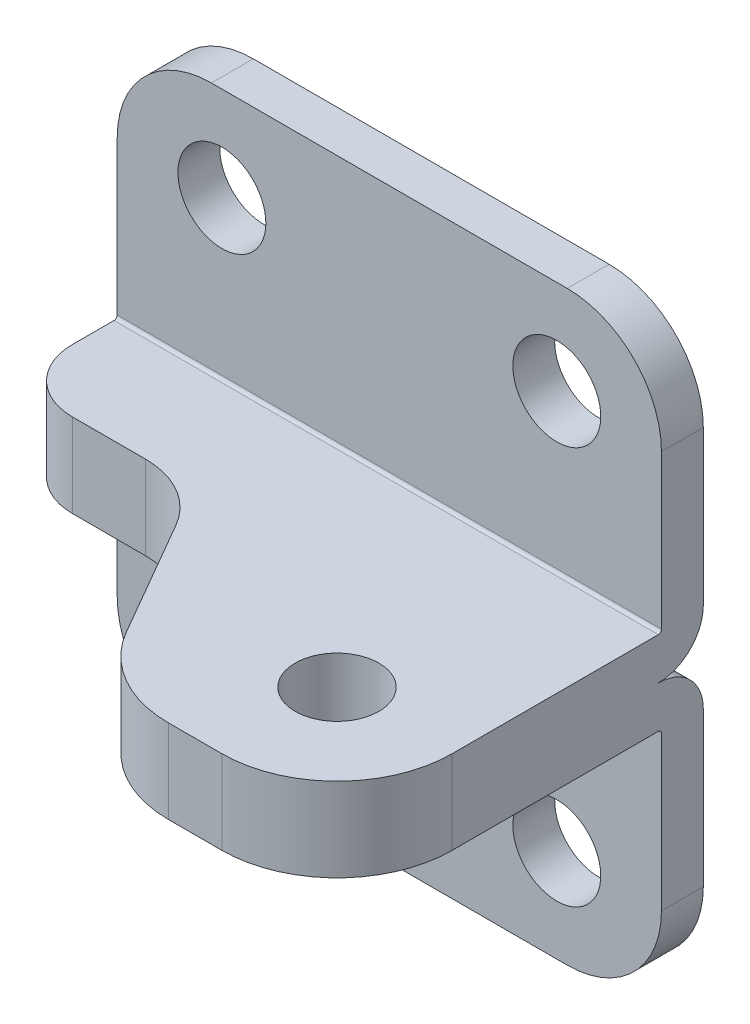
ISO-10303-21;
HEADER;
FILE_DESCRIPTION(('STEP AP214'),'2;1');
FILE_NAME('part.step','',(''),(''),'','','');
FILE_SCHEMA(('AUTOMOTIVE_DESIGN { 1 0 10303 214 1 1 1 1 }'));
ENDSEC;
DATA;
#1=APPLICATION_CONTEXT('core data for automotive mechanical design processes');
#2=APPLICATION_PROTOCOL_DEFINITION('international standard','automotive_design',2000,#1);
#3=PRODUCT_CONTEXT('',#1,'mechanical');
#4=PRODUCT('Part','Part','',(#3));
#5=PRODUCT_RELATED_PRODUCT_CATEGORY('part','',(#4));
#6=PRODUCT_DEFINITION_FORMATION('','',#4);
#7=PRODUCT_DEFINITION_CONTEXT('part definition',#1,'design');
#8=PRODUCT_DEFINITION('design','',#6,#7);
#9=PRODUCT_DEFINITION_SHAPE('','',#8);
#10=(LENGTH_UNIT() NAMED_UNIT(*) SI_UNIT(.MILLI.,.METRE.));
#11=(NAMED_UNIT(*) PLANE_ANGLE_UNIT() SI_UNIT($,.RADIAN.));
#12=(NAMED_UNIT(*) SI_UNIT($,.STERADIAN.) SOLID_ANGLE_UNIT());
#13=UNCERTAINTY_MEASURE_WITH_UNIT(LENGTH_MEASURE(1.E-05),#10,'distance_accuracy_value','');
#14=(GEOMETRIC_REPRESENTATION_CONTEXT(3) GLOBAL_UNCERTAINTY_ASSIGNED_CONTEXT((#13)) GLOBAL_UNIT_ASSIGNED_CONTEXT((#10,
#11,#12)) REPRESENTATION_CONTEXT('',''));
#15=CARTESIAN_POINT('',(0.,0.,0.));
#16=DIRECTION('',(0.,0.,1.));
#17=DIRECTION('',(1.,0.,0.));
#18=AXIS2_PLACEMENT_3D('',#15,#16,#17);
#19=CARTESIAN_POINT('',(8.70734122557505,27.9239179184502,0.320446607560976));
#20=DIRECTION('',(0.,-1.,0.));
#21=DIRECTION('',(0.,0.,-1.));
#22=AXIS2_PLACEMENT_3D('',#19,#20,#21);
#23=CYLINDRICAL_SURFACE('',#22,2.);
#24=CARTESIAN_POINT('',(8.70734122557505,27.9239179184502,0.320446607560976));
#25=DIRECTION('',(0.,-1.,0.));
#26=DIRECTION('',(0.,0.,-1.));
#27=AXIS2_PLACEMENT_3D('',#24,#25,#26);
#28=CIRCLE('',#27,2.);
#29=CARTESIAN_POINT('',(8.70734122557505,27.9239179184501,-1.67955339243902));
#30=VERTEX_POINT('',#29);
#31=EDGE_CURVE('E331',#30,#30,#28,.F.);
#32=ORIENTED_EDGE('',*,*,#31,.F.);
#33=EDGE_LOOP('',(#32));
#34=FACE_BOUND('',#33,.T.);
#35=CARTESIAN_POINT('',(8.70734122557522,31.9239179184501,0.320446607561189));
#36=DIRECTION('',(0.,-1.,0.));
#37=DIRECTION('',(0.,0.,-1.));
#38=AXIS2_PLACEMENT_3D('',#35,#36,#37);
#39=CIRCLE('',#38,2.);
#40=CARTESIAN_POINT('',(8.70734122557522,31.9239179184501,-1.67955339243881));
#41=VERTEX_POINT('',#40);
#42=EDGE_CURVE('E18',#41,#41,#39,.T.);
#43=ORIENTED_EDGE('',*,*,#42,.F.);
#44=EDGE_LOOP('',(#43));
#45=FACE_BOUND('',#44,.T.);
#46=ADVANCED_FACE('F14',(#34,#45),#23,.F.);
#47=CARTESIAN_POINT('',(8.70734122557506,27.9239179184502,0.320446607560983));
#48=DIRECTION('',(0.,1.,0.));
#49=DIRECTION('',(0.,0.,1.));
#50=AXIS2_PLACEMENT_3D('',#47,#48,#49);
#51=CYLINDRICAL_SURFACE('',#50,5.5);
#52=CARTESIAN_POINT('',(8.70734122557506,27.9239179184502,0.320446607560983));
#53=DIRECTION('',(0.,1.,0.));
#54=DIRECTION('',(0.,0.,1.));
#55=AXIS2_PLACEMENT_3D('',#52,#53,#54);
#56=CIRCLE('',#55,5.5);
#57=CARTESIAN_POINT('',(14.2073412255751,27.9239179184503,0.320446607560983));
#58=VERTEX_POINT('',#57);
#59=CARTESIAN_POINT('',(8.70734122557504,27.9239179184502,5.82044660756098));
#60=VERTEX_POINT('',#59);
#61=EDGE_CURVE('E173',#58,#60,#56,.F.);
#62=ORIENTED_EDGE('',*,*,#61,.F.);
#63=DIRECTION('',(0.,-1.,0.));
#64=VECTOR('',#63,1.);
#65=CARTESIAN_POINT('',(14.2073412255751,27.9239179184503,0.320446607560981));
#66=LINE('',#65,#64);
#67=CARTESIAN_POINT('',(14.2073412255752,31.9239179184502,0.320446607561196));
#68=VERTEX_POINT('',#67);
#69=EDGE_CURVE('E167',#58,#68,#66,.F.);
#70=ORIENTED_EDGE('',*,*,#69,.T.);
#71=CARTESIAN_POINT('',(8.70734122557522,31.9239179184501,0.320446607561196));
#72=DIRECTION('',(0.,1.,0.));
#73=DIRECTION('',(0.,0.,1.));
#74=AXIS2_PLACEMENT_3D('',#71,#72,#73);
#75=CIRCLE('',#74,5.5);
#76=CARTESIAN_POINT('',(8.70734122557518,31.92391791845,5.82044660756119));
#77=VERTEX_POINT('',#76);
#78=EDGE_CURVE('E170',#68,#77,#75,.F.);
#79=ORIENTED_EDGE('',*,*,#78,.T.);
#80=DIRECTION('',(0.,-1.,0.));
#81=VECTOR('',#80,1.);
#82=CARTESIAN_POINT('',(8.70734122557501,27.9239179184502,5.82044660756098));
#83=LINE('',#82,#81);
#84=EDGE_CURVE('E215',#77,#60,#83,.T.);
#85=ORIENTED_EDGE('',*,*,#84,.T.);
#86=EDGE_LOOP('',(#62,#70,#79,#85));
#87=FACE_BOUND('',#86,.T.);
#88=ADVANCED_FACE('F169',(#87),#51,.T.);
#89=CARTESIAN_POINT('',(8.70734122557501,27.9239179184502,5.82044660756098));
#90=DIRECTION('',(0.,0.,-1.));
#91=DIRECTION('',(1.,0.,0.));
#92=AXIS2_PLACEMENT_3D('',#89,#90,#91);
#93=PLANE('',#92);
#94=DIRECTION('',(0.,1.,0.));
#95=VECTOR('',#94,1.);
#96=CARTESIAN_POINT('',(6.15627039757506,27.9239179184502,5.82044660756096));
#97=LINE('',#96,#95);
#98=CARTESIAN_POINT('',(6.15627039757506,27.9239179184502,5.82044660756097));
#99=VERTEX_POINT('',#98);
#100=CARTESIAN_POINT('',(6.1562703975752,31.92391791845,5.82044660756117));
#101=VERTEX_POINT('',#100);
#102=EDGE_CURVE('E262',#99,#101,#97,.T.);
#103=ORIENTED_EDGE('',*,*,#102,.F.);
#104=DIRECTION('',(1.,0.,0.));
#105=VECTOR('',#104,1.);
#106=CARTESIAN_POINT('',(-8.79265877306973,27.92391791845,5.82044660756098));
#107=LINE('',#106,#105);
#108=EDGE_CURVE('E328',#60,#99,#107,.F.);
#109=ORIENTED_EDGE('',*,*,#108,.F.);
#110=ORIENTED_EDGE('',*,*,#84,.F.);
#111=DIRECTION('',(-1.,0.,0.));
#112=VECTOR('',#111,1.);
#113=CARTESIAN_POINT('',(8.70734122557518,31.92391791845,5.82044660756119));
#114=LINE('',#113,#112);
#115=EDGE_CURVE('E186',#101,#77,#114,.F.);
#116=ORIENTED_EDGE('',*,*,#115,.F.);
#117=EDGE_LOOP('',(#103,#109,#110,#116));
#118=FACE_BOUND('',#117,.T.);
#119=ADVANCED_FACE('F427',(#118),#93,.F.);
#120=CARTESIAN_POINT('',(6.15627039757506,27.9239179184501,0.320446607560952));
#121=DIRECTION('',(0.,1.,0.));
#122=DIRECTION('',(0.,0.,1.));
#123=AXIS2_PLACEMENT_3D('',#120,#121,#122);
#124=CYLINDRICAL_SURFACE('',#123,5.5);
#125=CARTESIAN_POINT('',(6.15627039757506,27.9239179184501,0.320446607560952));
#126=DIRECTION('',(0.,1.,0.));
#127=DIRECTION('',(0.,0.,1.));
#128=AXIS2_PLACEMENT_3D('',#125,#126,#127);
#129=CIRCLE('',#128,5.5);
#130=CARTESIAN_POINT('',(1.39313067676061,27.9239179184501,3.07044660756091));
#131=VERTEX_POINT('',#130);
#132=EDGE_CURVE('E326',#99,#131,#129,.F.);
#133=ORIENTED_EDGE('',*,*,#132,.F.);
#134=ORIENTED_EDGE('',*,*,#102,.T.);
#135=CARTESIAN_POINT('',(6.15627039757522,31.92391791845,0.320446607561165));
#136=DIRECTION('',(0.,1.,0.));
#137=DIRECTION('',(0.,0.,1.));
#138=AXIS2_PLACEMENT_3D('',#135,#136,#137);
#139=CIRCLE('',#138,5.5);
#140=CARTESIAN_POINT('',(1.39313067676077,31.92391791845,3.07044660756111));
#141=VERTEX_POINT('',#140);
#142=EDGE_CURVE('E210',#101,#141,#139,.F.);
#143=ORIENTED_EDGE('',*,*,#142,.T.);
#144=DIRECTION('',(0.,-1.,0.));
#145=VECTOR('',#144,1.);
#146=CARTESIAN_POINT('',(1.39313067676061,27.9239179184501,3.0704466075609));
#147=LINE('',#146,#145);
#148=EDGE_CURVE('E260',#141,#131,#147,.T.);
#149=ORIENTED_EDGE('',*,*,#148,.T.);
#150=EDGE_LOOP('',(#133,#134,#143,#149));
#151=FACE_BOUND('',#150,.T.);
#152=ADVANCED_FACE('F259',(#151),#124,.T.);
#153=CARTESIAN_POINT('',(1.39313067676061,27.9239179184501,3.0704466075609));
#154=DIRECTION('',(0.866025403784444,0.,-0.49999999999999));
#155=DIRECTION('',(0.49999999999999,0.,0.866025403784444));
#156=AXIS2_PLACEMENT_3D('',#153,#154,#155);
#157=PLANE('',#156);
#158=DIRECTION('',(0.,1.,0.));
#159=VECTOR('',#158,1.);
#160=CARTESIAN_POINT('',(-1.84858896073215,27.92391791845,-2.54437650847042));
#161=LINE('',#160,#159);
#162=CARTESIAN_POINT('',(-1.84858896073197,31.92391791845,-2.54437650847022));
#163=VERTEX_POINT('',#162);
#164=CARTESIAN_POINT('',(-1.84858896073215,27.92391791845,-2.54437650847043));
#165=VERTEX_POINT('',#164);
#166=EDGE_CURVE('E267',#163,#165,#161,.F.);
#167=ORIENTED_EDGE('',*,*,#166,.T.);
#168=DIRECTION('',(-0.499999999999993,0.,-0.866025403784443));
#169=VECTOR('',#168,1.);
#170=CARTESIAN_POINT('',(1.39313067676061,27.9239179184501,3.0704466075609));
#171=LINE('',#170,#169);
#172=EDGE_CURVE('E270',#131,#165,#171,.T.);
#173=ORIENTED_EDGE('',*,*,#172,.F.);
#174=ORIENTED_EDGE('',*,*,#148,.F.);
#175=DIRECTION('',(-0.49999999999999,0.,-0.866025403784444));
#176=VECTOR('',#175,1.);
#177=CARTESIAN_POINT('',(1.39313067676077,31.92391791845,3.07044660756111));
#178=LINE('',#177,#176);
#179=EDGE_CURVE('E207',#163,#141,#178,.F.);
#180=ORIENTED_EDGE('',*,*,#179,.F.);
#181=EDGE_LOOP('',(#167,#173,#174,#180));
#182=FACE_BOUND('',#181,.T.);
#183=ADVANCED_FACE('F266',(#182),#157,.F.);
#184=CARTESIAN_POINT('',(-5.31269057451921,27.92391791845,-0.544376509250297));
#185=DIRECTION('',(0.,1.,0.));
#186=DIRECTION('',(0.,0.,1.));
#187=AXIS2_PLACEMENT_3D('',#184,#185,#186);
#188=CYLINDRICAL_SURFACE('',#187,3.99999999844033);
#189=DIRECTION('',(0.,-1.,0.));
#190=VECTOR('',#189,1.);
#191=CARTESIAN_POINT('',(-5.31269057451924,27.92391791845,-4.54437650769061));
#192=LINE('',#191,#190);
#193=CARTESIAN_POINT('',(-5.31269057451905,31.92391791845,-4.5443765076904));
#194=VERTEX_POINT('',#193);
#195=CARTESIAN_POINT('',(-5.31269057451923,27.92391791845,-4.54437650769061));
#196=VERTEX_POINT('',#195);
#197=EDGE_CURVE('E273',#194,#196,#192,.T.);
#198=ORIENTED_EDGE('',*,*,#197,.T.);
#199=CARTESIAN_POINT('',(-5.31269057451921,27.92391791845,-0.544376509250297));
#200=DIRECTION('',(0.,1.,0.));
#201=DIRECTION('',(0.,0.,1.));
#202=AXIS2_PLACEMENT_3D('',#199,#200,#201);
#203=CIRCLE('',#202,3.99999999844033);
#204=EDGE_CURVE('E323',#165,#196,#203,.T.);
#205=ORIENTED_EDGE('',*,*,#204,.F.);
#206=ORIENTED_EDGE('',*,*,#166,.F.);
#207=CARTESIAN_POINT('',(-5.31269057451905,31.92391791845,-0.544376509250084));
#208=DIRECTION('',(0.,1.,0.));
#209=DIRECTION('',(0.,0.,1.));
#210=AXIS2_PLACEMENT_3D('',#207,#208,#209);
#211=CIRCLE('',#210,3.99999999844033);
#212=EDGE_CURVE('E206',#194,#163,#211,.F.);
#213=ORIENTED_EDGE('',*,*,#212,.F.);
#214=EDGE_LOOP('',(#198,#205,#206,#213));
#215=FACE_BOUND('',#214,.T.);
#216=ADVANCED_FACE('F416',(#215),#188,.F.);
#217=CARTESIAN_POINT('',(-5.31269057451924,27.92391791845,-4.54437650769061));
#218=DIRECTION('',(0.,0.,-1.));
#219=DIRECTION('',(1.,0.,0.));
#220=AXIS2_PLACEMENT_3D('',#217,#218,#219);
#221=PLANE('',#220);
#222=DIRECTION('',(0.,1.,0.));
#223=VECTOR('',#222,1.);
#224=CARTESIAN_POINT('',(-8.79265877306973,27.9239179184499,-4.54437650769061));
#225=LINE('',#224,#223);
#226=CARTESIAN_POINT('',(-8.79265877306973,27.9239179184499,-4.54437650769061));
#227=VERTEX_POINT('',#226);
#228=CARTESIAN_POINT('',(-8.79265877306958,31.92391791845,-4.54437650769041));
#229=VERTEX_POINT('',#228);
#230=EDGE_CURVE('E279',#227,#229,#225,.T.);
#231=ORIENTED_EDGE('',*,*,#230,.F.);
#232=DIRECTION('',(1.,0.,0.));
#233=VECTOR('',#232,1.);
#234=CARTESIAN_POINT('',(-8.79265877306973,27.9239179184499,-4.54437650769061));
#235=LINE('',#234,#233);
#236=EDGE_CURVE('E322',#196,#227,#235,.F.);
#237=ORIENTED_EDGE('',*,*,#236,.F.);
#238=ORIENTED_EDGE('',*,*,#197,.F.);
#239=DIRECTION('',(-1.,0.,0.));
#240=VECTOR('',#239,1.);
#241=CARTESIAN_POINT('',(-5.31269057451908,31.92391791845,-4.5443765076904));
#242=LINE('',#241,#240);
#243=EDGE_CURVE('E203',#229,#194,#242,.F.);
#244=ORIENTED_EDGE('',*,*,#243,.F.);
#245=EDGE_LOOP('',(#231,#237,#238,#244));
#246=FACE_BOUND('',#245,.T.);
#247=ADVANCED_FACE('F419',(#246),#221,.F.);
#248=CARTESIAN_POINT('',(-8.79265877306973,27.9239179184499,-7.54437650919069));
#249=DIRECTION('',(0.,1.,0.));
#250=DIRECTION('',(0.,0.,1.));
#251=AXIS2_PLACEMENT_3D('',#248,#249,#250);
#252=CYLINDRICAL_SURFACE('',#251,3.00000000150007);
#253=CARTESIAN_POINT('',(-8.79265877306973,27.9239179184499,-7.54437650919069));
#254=DIRECTION('',(0.,1.,0.));
#255=DIRECTION('',(0.,0.,1.));
#256=AXIS2_PLACEMENT_3D('',#253,#254,#255);
#257=CIRCLE('',#256,3.00000000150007);
#258=CARTESIAN_POINT('',(-11.7926587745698,27.9239179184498,-7.54437650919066));
#259=VERTEX_POINT('',#258);
#260=EDGE_CURVE('E319',#227,#259,#257,.F.);
#261=ORIENTED_EDGE('',*,*,#260,.F.);
#262=ORIENTED_EDGE('',*,*,#230,.T.);
#263=CARTESIAN_POINT('',(-8.79265877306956,31.92391791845,-7.54437650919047));
#264=DIRECTION('',(0.,1.,0.));
#265=DIRECTION('',(0.,0.,1.));
#266=AXIS2_PLACEMENT_3D('',#263,#264,#265);
#267=CIRCLE('',#266,3.00000000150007);
#268=CARTESIAN_POINT('',(-11.7926587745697,31.92391791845,-7.54437650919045));
#269=VERTEX_POINT('',#268);
#270=EDGE_CURVE('E197',#229,#269,#267,.F.);
#271=ORIENTED_EDGE('',*,*,#270,.T.);
#272=DIRECTION('',(0.,1.,0.));
#273=VECTOR('',#272,1.);
#274=CARTESIAN_POINT('',(-11.7926587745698,27.9239179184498,-7.54437650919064));
#275=LINE('',#274,#273);
#276=EDGE_CURVE('E178',#269,#259,#275,.F.);
#277=ORIENTED_EDGE('',*,*,#276,.T.);
#278=EDGE_LOOP('',(#261,#262,#271,#277));
#279=FACE_BOUND('',#278,.T.);
#280=ADVANCED_FACE('F480',(#279),#252,.T.);
#281=CARTESIAN_POINT('',(27.3466437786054,27.7739179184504,-9.52955338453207));
#282=DIRECTION('',(-1.,0.,0.));
#283=DIRECTION('',(0.,-1.,0.));
#284=AXIS2_PLACEMENT_3D('',#281,#282,#283);
#285=CYLINDRICAL_SURFACE('',#284,2.15);
#286=DIRECTION('',(-1.,0.,0.));
#287=VECTOR('',#286,1.);
#288=CARTESIAN_POINT('',(27.3466437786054,29.9239179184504,-9.52955338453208));
#289=LINE('',#288,#287);
#290=CARTESIAN_POINT('',(-11.7926587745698,29.9239179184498,-9.52955338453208));
#291=VERTEX_POINT('',#290);
#292=CARTESIAN_POINT('',(14.207341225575,29.9239179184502,-9.52955338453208));
#293=VERTEX_POINT('',#292);
#294=EDGE_CURVE('E177',#291,#293,#289,.F.);
#295=ORIENTED_EDGE('',*,*,#294,.T.);
#296=CARTESIAN_POINT('',(14.2073412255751,27.7739179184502,-9.52955338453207));
#297=DIRECTION('',(-1.,0.,0.));
#298=DIRECTION('',(0.,-1.,0.));
#299=AXIS2_PLACEMENT_3D('',#296,#297,#298);
#300=CIRCLE('',#299,2.15);
#301=CARTESIAN_POINT('',(14.2073412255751,27.7739179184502,-11.6795533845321));
#302=VERTEX_POINT('',#301);
#303=EDGE_CURVE('E314',#293,#302,#300,.T.);
#304=ORIENTED_EDGE('',*,*,#303,.T.);
#305=DIRECTION('',(1.,0.,0.));
#306=VECTOR('',#305,1.);
#307=CARTESIAN_POINT('',(-8.79265877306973,27.7739179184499,-11.6795533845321));
#308=LINE('',#307,#306);
#309=CARTESIAN_POINT('',(-11.7926587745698,27.7739179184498,-11.6795533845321));
#310=VERTEX_POINT('',#309);
#311=EDGE_CURVE('E313',#302,#310,#308,.F.);
#312=ORIENTED_EDGE('',*,*,#311,.T.);
#313=CARTESIAN_POINT('',(-11.7926587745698,27.7739179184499,-9.52955338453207));
#314=DIRECTION('',(-1.,0.,0.));
#315=DIRECTION('',(0.,-1.,0.));
#316=AXIS2_PLACEMENT_3D('',#313,#314,#315);
#317=CIRCLE('',#316,2.15);
#318=EDGE_CURVE('E316',#310,#291,#317,.F.);
#319=ORIENTED_EDGE('',*,*,#318,.T.);
#320=EDGE_LOOP('',(#295,#304,#312,#319));
#321=FACE_BOUND('',#320,.T.);
#322=ADVANCED_FACE('F390',(#321),#285,.T.);
#323=CARTESIAN_POINT('',(-8.79265877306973,27.9239179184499,-7.54437650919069));
#324=DIRECTION('',(0.,-1.,0.));
#325=DIRECTION('',(0.,0.,-1.));
#326=AXIS2_PLACEMENT_3D('',#323,#324,#325);
#327=PLANE('',#326);
#328=ORIENTED_EDGE('',*,*,#236,.T.);
#329=ORIENTED_EDGE('',*,*,#260,.T.);
#330=DIRECTION('',(0.,0.,-1.));
#331=VECTOR('',#330,1.);
#332=CARTESIAN_POINT('',(-11.7926587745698,27.9239179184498,-7.54437650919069));
#333=LINE('',#332,#331);
#334=CARTESIAN_POINT('',(-11.7926587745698,27.9239179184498,-9.52955338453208));
#335=VERTEX_POINT('',#334);
#336=EDGE_CURVE('E334',#259,#335,#333,.T.);
#337=ORIENTED_EDGE('',*,*,#336,.T.);
#338=DIRECTION('',(-1.,0.,0.));
#339=VECTOR('',#338,1.);
#340=CARTESIAN_POINT('',(27.3466437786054,27.9239179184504,-9.52955338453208));
#341=LINE('',#340,#339);
#342=CARTESIAN_POINT('',(14.207341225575,27.9239179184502,-9.52955338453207));
#343=VERTEX_POINT('',#342);
#344=EDGE_CURVE('E310',#335,#343,#341,.F.);
#345=ORIENTED_EDGE('',*,*,#344,.T.);
#346=DIRECTION('',(0.,0.,-1.));
#347=VECTOR('',#346,1.);
#348=CARTESIAN_POINT('',(14.2073412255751,27.9239179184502,-7.54437650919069));
#349=LINE('',#348,#347);
#350=EDGE_CURVE('E330',#343,#58,#349,.F.);
#351=ORIENTED_EDGE('',*,*,#350,.T.);
#352=ORIENTED_EDGE('',*,*,#61,.T.);
#353=ORIENTED_EDGE('',*,*,#108,.T.);
#354=ORIENTED_EDGE('',*,*,#132,.T.);
#355=ORIENTED_EDGE('',*,*,#172,.T.);
#356=ORIENTED_EDGE('',*,*,#204,.T.);
#357=EDGE_LOOP('',(#328,#329,#337,#345,#351,#352,#353,#354,#355,#356));
#358=FACE_BOUND('',#357,.T.);
#359=ORIENTED_EDGE('',*,*,#31,.T.);
#360=EDGE_LOOP('',(#359));
#361=FACE_BOUND('',#360,.T.);
#362=ADVANCED_FACE('F422',(#358,#361),#327,.T.);
#363=CARTESIAN_POINT('',(-8.79265877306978,31.5655105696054,-11.6795533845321));
#364=DIRECTION('',(0.,0.,1.));
#365=DIRECTION('',(0.,-1.,0.));
#366=AXIS2_PLACEMENT_3D('',#363,#364,#365);
#367=PLANE('',#366);
#368=ORIENTED_EDGE('',*,*,#311,.F.);
#369=DIRECTION('',(0.,-1.,0.));
#370=VECTOR('',#369,1.);
#371=CARTESIAN_POINT('',(14.2073412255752,20.4239179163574,-11.679553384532));
#372=LINE('',#371,#370);
#373=CARTESIAN_POINT('',(14.2073412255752,20.4239179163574,-11.679553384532));
#374=VERTEX_POINT('',#373);
#375=EDGE_CURVE('E299',#302,#374,#372,.T.);
#376=ORIENTED_EDGE('',*,*,#375,.T.);
#377=CARTESIAN_POINT('',(9.70734122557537,20.4239179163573,-11.679553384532));
#378=DIRECTION('',(0.,0.,-1.));
#379=DIRECTION('',(0.,1.,0.));
#380=AXIS2_PLACEMENT_3D('',#377,#378,#379);
#381=CIRCLE('',#380,4.4999999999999);
#382=CARTESIAN_POINT('',(9.70734122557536,15.9239179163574,-11.679553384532));
#383=VERTEX_POINT('',#382);
#384=EDGE_CURVE('E300',#383,#374,#381,.F.);
#385=ORIENTED_EDGE('',*,*,#384,.F.);
#386=DIRECTION('',(-1.,0.,0.));
#387=VECTOR('',#386,1.);
#388=CARTESIAN_POINT('',(-7.29265877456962,15.923917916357,-11.679553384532));
#389=LINE('',#388,#387);
#390=CARTESIAN_POINT('',(-7.29265877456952,15.923917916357,-11.679553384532));
#391=VERTEX_POINT('',#390);
#392=EDGE_CURVE('E303',#383,#391,#389,.T.);
#393=ORIENTED_EDGE('',*,*,#392,.T.);
#394=CARTESIAN_POINT('',(-7.29265877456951,20.4239179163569,-11.679553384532));
#395=DIRECTION('',(0.,0.,-1.));
#396=DIRECTION('',(0.,1.,0.));
#397=AXIS2_PLACEMENT_3D('',#394,#395,#396);
#398=CIRCLE('',#397,4.50000000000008);
#399=CARTESIAN_POINT('',(-11.7926587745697,20.4239179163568,-11.679553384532));
#400=VERTEX_POINT('',#399);
#401=EDGE_CURVE('E304',#400,#391,#398,.F.);
#402=ORIENTED_EDGE('',*,*,#401,.F.);
#403=DIRECTION('',(0.,1.,0.));
#404=VECTOR('',#403,1.);
#405=CARTESIAN_POINT('',(-11.7926587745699,31.5655105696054,-11.6795533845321));
#406=LINE('',#405,#404);
#407=EDGE_CURVE('E307',#400,#310,#406,.T.);
#408=ORIENTED_EDGE('',*,*,#407,.T.);
#409=EDGE_LOOP('',(#368,#376,#385,#393,#402,#408));
#410=FACE_BOUND('',#409,.T.);
#411=CARTESIAN_POINT('',(9.20734122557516,20.4239179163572,-11.679553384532));
#412=DIRECTION('',(0.,0.,1.));
#413=DIRECTION('',(0.,-1.,0.));
#414=AXIS2_PLACEMENT_3D('',#411,#412,#413);
#415=CIRCLE('',#414,2.1);
#416=CARTESIAN_POINT('',(9.20734122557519,18.3239179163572,-11.679553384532));
#417=VERTEX_POINT('',#416);
#418=EDGE_CURVE('E296',#417,#417,#415,.T.);
#419=ORIENTED_EDGE('',*,*,#418,.T.);
#420=EDGE_LOOP('',(#419));
#421=FACE_BOUND('',#420,.T.);
#422=CARTESIAN_POINT('',(-6.79265877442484,20.4239179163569,-11.679553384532));
#423=DIRECTION('',(0.,0.,1.));
#424=DIRECTION('',(0.,-1.,0.));
#425=AXIS2_PLACEMENT_3D('',#422,#423,#424);
#426=CIRCLE('',#425,2.1);
#427=CARTESIAN_POINT('',(-6.79265877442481,18.3239179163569,-11.679553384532));
#428=VERTEX_POINT('',#427);
#429=EDGE_CURVE('E292',#428,#428,#426,.T.);
#430=ORIENTED_EDGE('',*,*,#429,.T.);
#431=EDGE_LOOP('',(#430));
#432=FACE_BOUND('',#431,.T.);
#433=ADVANCED_FACE('F396',(#410,#421,#432),#367,.F.);
#434=CARTESIAN_POINT('',(27.3466437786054,27.7739179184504,-9.52955338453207));
#435=DIRECTION('',(-1.,0.,0.));
#436=DIRECTION('',(0.,-1.,0.));
#437=AXIS2_PLACEMENT_3D('',#434,#435,#436);
#438=CYLINDRICAL_SURFACE('',#437,0.15);
#439=CARTESIAN_POINT('',(14.2073412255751,27.7739179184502,-9.52955338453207));
#440=DIRECTION('',(-1.,0.,0.));
#441=DIRECTION('',(0.,-1.,0.));
#442=AXIS2_PLACEMENT_3D('',#439,#440,#441);
#443=CIRCLE('',#442,0.15);
#444=CARTESIAN_POINT('',(14.2073412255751,27.7739179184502,-9.67955338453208));
#445=VERTEX_POINT('',#444);
#446=EDGE_CURVE('E308',#343,#445,#443,.T.);
#447=ORIENTED_EDGE('',*,*,#446,.F.);
#448=ORIENTED_EDGE('',*,*,#344,.F.);
#449=CARTESIAN_POINT('',(-11.7926587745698,27.7739179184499,-9.52955338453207));
#450=DIRECTION('',(-1.,0.,0.));
#451=DIRECTION('',(0.,-1.,0.));
#452=AXIS2_PLACEMENT_3D('',#449,#450,#451);
#453=CIRCLE('',#452,0.15);
#454=CARTESIAN_POINT('',(-11.7926587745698,27.7739179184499,-9.67955338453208));
#455=VERTEX_POINT('',#454);
#456=EDGE_CURVE('E311',#455,#335,#453,.F.);
#457=ORIENTED_EDGE('',*,*,#456,.F.);
#458=DIRECTION('',(1.,0.,0.));
#459=VECTOR('',#458,1.);
#460=CARTESIAN_POINT('',(-8.79265877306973,27.7739179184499,-9.67955338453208));
#461=LINE('',#460,#459);
#462=EDGE_CURVE('E295',#445,#455,#461,.F.);
#463=ORIENTED_EDGE('',*,*,#462,.F.);
#464=EDGE_LOOP('',(#447,#448,#457,#463));
#465=FACE_BOUND('',#464,.T.);
#466=ADVANCED_FACE('F484',(#465),#438,.F.);
#467=CARTESIAN_POINT('',(-11.7926587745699,31.5655105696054,-9.67955338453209));
#468=DIRECTION('',(1.,0.,0.));
#469=DIRECTION('',(0.,1.,0.));
#470=AXIS2_PLACEMENT_3D('',#467,#468,#469);
#471=PLANE('',#470);
#472=DIRECTION('',(0.,-1.,0.));
#473=VECTOR('',#472,1.);
#474=CARTESIAN_POINT('',(-11.7926587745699,31.5655105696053,-9.67955338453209));
#475=LINE('',#474,#473);
#476=CARTESIAN_POINT('',(-11.7926587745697,20.4239179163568,-9.67955338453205));
#477=VERTEX_POINT('',#476);
#478=EDGE_CURVE('E291',#455,#477,#475,.T.);
#479=ORIENTED_EDGE('',*,*,#478,.F.);
#480=ORIENTED_EDGE('',*,*,#456,.T.);
#481=ORIENTED_EDGE('',*,*,#336,.F.);
#482=ORIENTED_EDGE('',*,*,#276,.F.);
#483=DIRECTION('',(0.,0.,-1.));
#484=VECTOR('',#483,1.);
#485=CARTESIAN_POINT('',(-11.7926587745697,31.92391791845,-7.54437650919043));
#486=LINE('',#485,#484);
#487=CARTESIAN_POINT('',(-11.7926587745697,31.92391791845,-9.52955338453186));
#488=VERTEX_POINT('',#487);
#489=EDGE_CURVE('E193',#488,#269,#486,.F.);
#490=ORIENTED_EDGE('',*,*,#489,.F.);
#491=CARTESIAN_POINT('',(-11.7926587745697,32.07391791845,-9.52955338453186));
#492=DIRECTION('',(-1.,0.,0.));
#493=DIRECTION('',(0.,1.,0.));
#494=AXIS2_PLACEMENT_3D('',#491,#492,#493);
#495=CIRCLE('',#494,0.15);
#496=CARTESIAN_POINT('',(-11.7926587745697,32.07391791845,-9.67955338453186));
#497=VERTEX_POINT('',#496);
#498=EDGE_CURVE('E195',#488,#497,#495,.F.);
#499=ORIENTED_EDGE('',*,*,#498,.T.);
#500=DIRECTION('',(0.,-1.,0.));
#501=VECTOR('',#500,1.);
#502=CARTESIAN_POINT('',(-11.7926587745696,28.2823252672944,-9.67955338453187));
#503=LINE('',#502,#501);
#504=CARTESIAN_POINT('',(-11.7926587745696,39.4239179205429,-9.67955338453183));
#505=VERTEX_POINT('',#504);
#506=EDGE_CURVE('E200',#505,#497,#503,.T.);
#507=ORIENTED_EDGE('',*,*,#506,.F.);
#508=DIRECTION('',(0.,0.,1.));
#509=VECTOR('',#508,1.);
#510=CARTESIAN_POINT('',(-11.7926587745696,39.4239179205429,-11.6795533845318));
#511=LINE('',#510,#509);
#512=CARTESIAN_POINT('',(-11.7926587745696,39.4239179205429,-11.6795533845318));
#513=VERTEX_POINT('',#512);
#514=EDGE_CURVE('E242',#513,#505,#511,.T.);
#515=ORIENTED_EDGE('',*,*,#514,.F.);
#516=DIRECTION('',(0.,1.,0.));
#517=VECTOR('',#516,1.);
#518=CARTESIAN_POINT('',(-11.7926587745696,28.2823252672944,-11.6795533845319));
#519=LINE('',#518,#517);
#520=CARTESIAN_POINT('',(-11.7926587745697,32.07391791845,-11.6795533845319));
#521=VERTEX_POINT('',#520);
#522=EDGE_CURVE('E227',#521,#513,#519,.T.);
#523=ORIENTED_EDGE('',*,*,#522,.F.);
#524=CARTESIAN_POINT('',(-11.7926587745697,32.07391791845,-9.52955338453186));
#525=DIRECTION('',(-1.,0.,0.));
#526=DIRECTION('',(0.,1.,0.));
#527=AXIS2_PLACEMENT_3D('',#524,#525,#526);
#528=CIRCLE('',#527,2.15);
#529=EDGE_CURVE('E243',#291,#521,#528,.F.);
#530=ORIENTED_EDGE('',*,*,#529,.F.);
#531=ORIENTED_EDGE('',*,*,#318,.F.);
#532=ORIENTED_EDGE('',*,*,#407,.F.);
#533=DIRECTION('',(0.,0.,-1.));
#534=VECTOR('',#533,1.);
#535=CARTESIAN_POINT('',(-11.7926587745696,20.4239179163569,-9.67955338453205));
#536=LINE('',#535,#534);
#537=EDGE_CURVE('E306',#477,#400,#536,.T.);
#538=ORIENTED_EDGE('',*,*,#537,.F.);
#539=EDGE_LOOP('',(#479,#480,#481,#482,#490,#499,#507,#515,#523,#530,#531,#532,#538));
#540=FACE_BOUND('',#539,.T.);
#541=ADVANCED_FACE('F371',(#540),#471,.F.);
#542=CARTESIAN_POINT('',(-7.29265877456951,20.4239179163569,-9.67955338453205));
#543=DIRECTION('',(0.,0.,-1.));
#544=DIRECTION('',(0.,1.,0.));
#545=AXIS2_PLACEMENT_3D('',#542,#543,#544);
#546=CYLINDRICAL_SURFACE('',#545,4.50000000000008);
#547=CARTESIAN_POINT('',(-7.29265877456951,20.4239179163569,-9.67955338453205));
#548=DIRECTION('',(0.,0.,-1.));
#549=DIRECTION('',(0.,1.,0.));
#550=AXIS2_PLACEMENT_3D('',#547,#548,#549);
#551=CIRCLE('',#550,4.50000000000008);
#552=CARTESIAN_POINT('',(-7.29265877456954,15.923917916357,-9.67955338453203));
#553=VERTEX_POINT('',#552);
#554=EDGE_CURVE('E288',#477,#553,#551,.F.);
#555=ORIENTED_EDGE('',*,*,#554,.F.);
#556=ORIENTED_EDGE('',*,*,#537,.T.);
#557=ORIENTED_EDGE('',*,*,#401,.T.);
#558=DIRECTION('',(0.,0.,1.));
#559=VECTOR('',#558,1.);
#560=CARTESIAN_POINT('',(-7.29265877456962,15.923917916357,-9.67955338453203));
#561=LINE('',#560,#559);
#562=EDGE_CURVE('E500',#391,#553,#561,.T.);
#563=ORIENTED_EDGE('',*,*,#562,.T.);
#564=EDGE_LOOP('',(#555,#556,#557,#563));
#565=FACE_BOUND('',#564,.T.);
#566=ADVANCED_FACE('F507',(#565),#546,.T.);
#567=CARTESIAN_POINT('',(-7.29265877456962,15.923917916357,-9.67955338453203));
#568=DIRECTION('',(0.,1.,0.));
#569=DIRECTION('',(-1.,0.,0.));
#570=AXIS2_PLACEMENT_3D('',#567,#568,#569);
#571=PLANE('',#570);
#572=DIRECTION('',(0.,0.,-1.));
#573=VECTOR('',#572,1.);
#574=CARTESIAN_POINT('',(9.70734122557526,15.9239179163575,-9.67955338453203));
#575=LINE('',#574,#573);
#576=CARTESIAN_POINT('',(9.70734122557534,15.9239179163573,-9.67955338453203));
#577=VERTEX_POINT('',#576);
#578=EDGE_CURVE('E302',#577,#383,#575,.T.);
#579=ORIENTED_EDGE('',*,*,#578,.F.);
#580=DIRECTION('',(1.,0.,0.));
#581=VECTOR('',#580,1.);
#582=CARTESIAN_POINT('',(-8.79265877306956,15.923917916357,-9.67955338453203));
#583=LINE('',#582,#581);
#584=EDGE_CURVE('E287',#553,#577,#583,.T.);
#585=ORIENTED_EDGE('',*,*,#584,.F.);
#586=ORIENTED_EDGE('',*,*,#562,.F.);
#587=ORIENTED_EDGE('',*,*,#392,.F.);
#588=EDGE_LOOP('',(#579,#585,#586,#587));
#589=FACE_BOUND('',#588,.T.);
#590=ADVANCED_FACE('F504',(#589),#571,.F.);
#591=CARTESIAN_POINT('',(9.70734122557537,20.4239179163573,-9.67955338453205));
#592=DIRECTION('',(0.,0.,-1.));
#593=DIRECTION('',(0.,1.,0.));
#594=AXIS2_PLACEMENT_3D('',#591,#592,#593);
#595=CYLINDRICAL_SURFACE('',#594,4.4999999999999);
#596=CARTESIAN_POINT('',(9.70734122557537,20.4239179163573,-9.67955338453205));
#597=DIRECTION('',(0.,0.,-1.));
#598=DIRECTION('',(0.,1.,0.));
#599=AXIS2_PLACEMENT_3D('',#596,#597,#598);
#600=CIRCLE('',#599,4.4999999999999);
#601=CARTESIAN_POINT('',(14.2073412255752,20.4239179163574,-9.67955338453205));
#602=VERTEX_POINT('',#601);
#603=EDGE_CURVE('E284',#577,#602,#600,.F.);
#604=ORIENTED_EDGE('',*,*,#603,.F.);
#605=ORIENTED_EDGE('',*,*,#578,.T.);
#606=ORIENTED_EDGE('',*,*,#384,.T.);
#607=DIRECTION('',(0.,0.,1.));
#608=VECTOR('',#607,1.);
#609=CARTESIAN_POINT('',(14.2073412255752,20.4239179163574,-9.67955338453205));
#610=LINE('',#609,#608);
#611=EDGE_CURVE('E33',#374,#602,#610,.T.);
#612=ORIENTED_EDGE('',*,*,#611,.T.);
#613=EDGE_LOOP('',(#604,#605,#606,#612));
#614=FACE_BOUND('',#613,.T.);
#615=ADVANCED_FACE('F493',(#614),#595,.T.);
#616=CARTESIAN_POINT('',(14.2073412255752,20.4239179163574,-9.67955338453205));
#617=DIRECTION('',(-1.,0.,0.));
#618=DIRECTION('',(0.,-1.,0.));
#619=AXIS2_PLACEMENT_3D('',#616,#617,#618);
#620=PLANE('',#619);
#621=ORIENTED_EDGE('',*,*,#375,.F.);
#622=ORIENTED_EDGE('',*,*,#303,.F.);
#623=CARTESIAN_POINT('',(14.2073412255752,32.0739179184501,-9.52955338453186));
#624=DIRECTION('',(-1.,0.,0.));
#625=DIRECTION('',(0.,1.,0.));
#626=AXIS2_PLACEMENT_3D('',#623,#624,#625);
#627=CIRCLE('',#626,2.15);
#628=CARTESIAN_POINT('',(14.2073412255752,32.0739179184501,-11.6795533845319));
#629=VERTEX_POINT('',#628);
#630=EDGE_CURVE('E245',#629,#293,#627,.T.);
#631=ORIENTED_EDGE('',*,*,#630,.F.);
#632=DIRECTION('',(0.,1.,0.));
#633=VECTOR('',#632,1.);
#634=CARTESIAN_POINT('',(14.2073412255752,28.2823252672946,-11.6795533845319));
#635=LINE('',#634,#633);
#636=CARTESIAN_POINT('',(14.2073412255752,39.4239179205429,-11.6795533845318));
#637=VERTEX_POINT('',#636);
#638=EDGE_CURVE('E219',#637,#629,#635,.F.);
#639=ORIENTED_EDGE('',*,*,#638,.F.);
#640=DIRECTION('',(0.,0.,-1.));
#641=VECTOR('',#640,1.);
#642=CARTESIAN_POINT('',(14.2073412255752,39.423917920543,-11.6795533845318));
#643=LINE('',#642,#641);
#644=CARTESIAN_POINT('',(14.2073412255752,39.4239179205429,-9.67955338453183));
#645=VERTEX_POINT('',#644);
#646=EDGE_CURVE('E341',#645,#637,#643,.T.);
#647=ORIENTED_EDGE('',*,*,#646,.F.);
#648=DIRECTION('',(0.,1.,0.));
#649=VECTOR('',#648,1.);
#650=CARTESIAN_POINT('',(14.2073412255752,39.4239179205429,-9.67955338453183));
#651=LINE('',#650,#649);
#652=CARTESIAN_POINT('',(14.2073412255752,32.0739179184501,-9.67955338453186));
#653=VERTEX_POINT('',#652);
#654=EDGE_CURVE('E235',#653,#645,#651,.T.);
#655=ORIENTED_EDGE('',*,*,#654,.F.);
#656=CARTESIAN_POINT('',(14.2073412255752,32.0739179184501,-9.52955338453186));
#657=DIRECTION('',(-1.,0.,0.));
#658=DIRECTION('',(0.,1.,0.));
#659=AXIS2_PLACEMENT_3D('',#656,#657,#658);
#660=CIRCLE('',#659,0.15);
#661=CARTESIAN_POINT('',(14.2073412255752,31.9239179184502,-9.52955338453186));
#662=VERTEX_POINT('',#661);
#663=EDGE_CURVE('E191',#653,#662,#660,.T.);
#664=ORIENTED_EDGE('',*,*,#663,.T.);
#665=DIRECTION('',(0.,0.,1.));
#666=VECTOR('',#665,1.);
#667=CARTESIAN_POINT('',(14.2073412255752,31.9239179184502,-18.6859691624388));
#668=LINE('',#667,#666);
#669=EDGE_CURVE('E182',#68,#662,#668,.F.);
#670=ORIENTED_EDGE('',*,*,#669,.F.);
#671=ORIENTED_EDGE('',*,*,#69,.F.);
#672=ORIENTED_EDGE('',*,*,#350,.F.);
#673=ORIENTED_EDGE('',*,*,#446,.T.);
#674=DIRECTION('',(0.,-1.,0.));
#675=VECTOR('',#674,1.);
#676=CARTESIAN_POINT('',(14.207341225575,31.5655105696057,-9.67955338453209));
#677=LINE('',#676,#675);
#678=EDGE_CURVE('E283',#602,#445,#677,.F.);
#679=ORIENTED_EDGE('',*,*,#678,.F.);
#680=ORIENTED_EDGE('',*,*,#611,.F.);
#681=EDGE_LOOP('',(#621,#622,#631,#639,#647,#655,#664,#670,#671,#672,#673,#679,#680));
#682=FACE_BOUND('',#681,.T.);
#683=ADVANCED_FACE('F189',(#682),#620,.F.);
#684=CARTESIAN_POINT('',(9.20734122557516,20.4239179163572,-9.67955338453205));
#685=DIRECTION('',(0.,0.,1.));
#686=DIRECTION('',(0.,-1.,0.));
#687=AXIS2_PLACEMENT_3D('',#684,#685,#686);
#688=CYLINDRICAL_SURFACE('',#687,2.1);
#689=CARTESIAN_POINT('',(9.20734122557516,20.4239179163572,-9.67955338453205));
#690=DIRECTION('',(0.,0.,1.));
#691=DIRECTION('',(0.,-1.,0.));
#692=AXIS2_PLACEMENT_3D('',#689,#690,#691);
#693=CIRCLE('',#692,2.1);
#694=CARTESIAN_POINT('',(9.20734122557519,18.3239179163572,-9.67955338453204));
#695=VERTEX_POINT('',#694);
#696=EDGE_CURVE('E24',#695,#695,#693,.F.);
#697=ORIENTED_EDGE('',*,*,#696,.F.);
#698=EDGE_LOOP('',(#697));
#699=FACE_BOUND('',#698,.T.);
#700=ORIENTED_EDGE('',*,*,#418,.F.);
#701=EDGE_LOOP('',(#700));
#702=FACE_BOUND('',#701,.T.);
#703=ADVANCED_FACE('F613',(#699,#702),#688,.F.);
#704=CARTESIAN_POINT('',(-6.79265877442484,20.4239179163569,-9.67955338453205));
#705=DIRECTION('',(0.,0.,1.));
#706=DIRECTION('',(0.,-1.,0.));
#707=AXIS2_PLACEMENT_3D('',#704,#705,#706);
#708=CYLINDRICAL_SURFACE('',#707,2.1);
#709=CARTESIAN_POINT('',(-6.79265877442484,20.4239179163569,-9.67955338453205));
#710=DIRECTION('',(0.,0.,1.));
#711=DIRECTION('',(0.,-1.,0.));
#712=AXIS2_PLACEMENT_3D('',#709,#710,#711);
#713=CIRCLE('',#712,2.1);
#714=CARTESIAN_POINT('',(-6.79265877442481,18.3239179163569,-9.67955338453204));
#715=VERTEX_POINT('',#714);
#716=EDGE_CURVE('E9',#715,#715,#713,.F.);
#717=ORIENTED_EDGE('',*,*,#716,.F.);
#718=EDGE_LOOP('',(#717));
#719=FACE_BOUND('',#718,.T.);
#720=ORIENTED_EDGE('',*,*,#429,.F.);
#721=EDGE_LOOP('',(#720));
#722=FACE_BOUND('',#721,.T.);
#723=ADVANCED_FACE('F460',(#719,#722),#708,.F.);
#724=CARTESIAN_POINT('',(-8.79265877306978,31.5655105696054,-9.67955338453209));
#725=DIRECTION('',(0.,0.,1.));
#726=DIRECTION('',(0.,-1.,0.));
#727=AXIS2_PLACEMENT_3D('',#724,#725,#726);
#728=PLANE('',#727);
#729=ORIENTED_EDGE('',*,*,#716,.T.);
#730=EDGE_LOOP('',(#729));
#731=FACE_BOUND('',#730,.T.);
#732=ORIENTED_EDGE('',*,*,#696,.T.);
#733=EDGE_LOOP('',(#732));
#734=FACE_BOUND('',#733,.T.);
#735=ORIENTED_EDGE('',*,*,#603,.T.);
#736=ORIENTED_EDGE('',*,*,#678,.T.);
#737=ORIENTED_EDGE('',*,*,#462,.T.);
#738=ORIENTED_EDGE('',*,*,#478,.T.);
#739=ORIENTED_EDGE('',*,*,#554,.T.);
#740=ORIENTED_EDGE('',*,*,#584,.T.);
#741=EDGE_LOOP('',(#735,#736,#737,#738,#739,#740));
#742=FACE_BOUND('',#741,.T.);
#743=ADVANCED_FACE('F452',(#731,#734,#742),#728,.T.);
#744=CARTESIAN_POINT('',(-6.79265877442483,39.4239179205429,-11.6795533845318));
#745=DIRECTION('',(0.,0.,-1.));
#746=DIRECTION('',(0.,1.,0.));
#747=AXIS2_PLACEMENT_3D('',#744,#745,#746);
#748=CYLINDRICAL_SURFACE('',#747,2.1);
#749=CARTESIAN_POINT('',(-6.79265877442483,39.4239179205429,-11.6795533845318));
#750=DIRECTION('',(0.,0.,-1.));
#751=DIRECTION('',(0.,1.,0.));
#752=AXIS2_PLACEMENT_3D('',#749,#750,#751);
#753=CIRCLE('',#752,2.1);
#754=CARTESIAN_POINT('',(-6.79265877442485,41.5239179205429,-11.6795533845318));
#755=VERTEX_POINT('',#754);
#756=EDGE_CURVE('E212',#755,#755,#753,.F.);
#757=ORIENTED_EDGE('',*,*,#756,.F.);
#758=EDGE_LOOP('',(#757));
#759=FACE_BOUND('',#758,.T.);
#760=CARTESIAN_POINT('',(-6.79265877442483,39.4239179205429,-9.67955338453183));
#761=DIRECTION('',(0.,0.,-1.));
#762=DIRECTION('',(0.,1.,0.));
#763=AXIS2_PLACEMENT_3D('',#760,#761,#762);
#764=CIRCLE('',#763,2.1);
#765=CARTESIAN_POINT('',(-6.79265877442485,41.5239179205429,-9.67955338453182));
#766=VERTEX_POINT('',#765);
#767=EDGE_CURVE('E228',#766,#766,#764,.T.);
#768=ORIENTED_EDGE('',*,*,#767,.F.);
#769=EDGE_LOOP('',(#768));
#770=FACE_BOUND('',#769,.T.);
#771=ADVANCED_FACE('F440',(#759,#770),#748,.F.);
#772=CARTESIAN_POINT('',(9.20734122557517,39.4239179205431,-11.6795533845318));
#773=DIRECTION('',(0.,0.,-1.));
#774=DIRECTION('',(0.,1.,0.));
#775=AXIS2_PLACEMENT_3D('',#772,#773,#774);
#776=CYLINDRICAL_SURFACE('',#775,2.1);
#777=CARTESIAN_POINT('',(9.20734122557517,39.4239179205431,-11.6795533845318));
#778=DIRECTION('',(0.,0.,-1.));
#779=DIRECTION('',(0.,1.,0.));
#780=AXIS2_PLACEMENT_3D('',#777,#778,#779);
#781=CIRCLE('',#780,2.1);
#782=CARTESIAN_POINT('',(9.20734122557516,41.523917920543,-11.6795533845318));
#783=VERTEX_POINT('',#782);
#784=EDGE_CURVE('E216',#783,#783,#781,.F.);
#785=ORIENTED_EDGE('',*,*,#784,.F.);
#786=EDGE_LOOP('',(#785));
#787=FACE_BOUND('',#786,.T.);
#788=CARTESIAN_POINT('',(9.20734122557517,39.4239179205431,-9.67955338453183));
#789=DIRECTION('',(0.,0.,-1.));
#790=DIRECTION('',(0.,1.,0.));
#791=AXIS2_PLACEMENT_3D('',#788,#789,#790);
#792=CIRCLE('',#791,2.1);
#793=CARTESIAN_POINT('',(9.20734122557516,41.523917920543,-9.67955338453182));
#794=VERTEX_POINT('',#793);
#795=EDGE_CURVE('E232',#794,#794,#792,.T.);
#796=ORIENTED_EDGE('',*,*,#795,.F.);
#797=EDGE_LOOP('',(#796));
#798=FACE_BOUND('',#797,.T.);
#799=ADVANCED_FACE('F447',(#787,#798),#776,.F.);
#800=CARTESIAN_POINT('',(-7.29265877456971,43.9239179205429,-11.6795533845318));
#801=DIRECTION('',(0.,-1.,0.));
#802=DIRECTION('',(-1.,0.,0.));
#803=AXIS2_PLACEMENT_3D('',#800,#801,#802);
#804=PLANE('',#803);
#805=DIRECTION('',(0.,0.,1.));
#806=VECTOR('',#805,1.);
#807=CARTESIAN_POINT('',(9.70734122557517,43.9239179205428,-11.6795533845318));
#808=LINE('',#807,#806);
#809=CARTESIAN_POINT('',(9.70734122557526,43.9239179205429,-11.6795533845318));
#810=VERTEX_POINT('',#809);
#811=CARTESIAN_POINT('',(9.70734122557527,43.9239179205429,-9.67955338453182));
#812=VERTEX_POINT('',#811);
#813=EDGE_CURVE('E238',#810,#812,#808,.T.);
#814=ORIENTED_EDGE('',*,*,#813,.F.);
#815=DIRECTION('',(1.,0.,0.));
#816=VECTOR('',#815,1.);
#817=CARTESIAN_POINT('',(-8.79265877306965,43.9239179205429,-11.6795533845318));
#818=LINE('',#817,#816);
#819=CARTESIAN_POINT('',(-7.29265877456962,43.9239179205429,-11.6795533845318));
#820=VERTEX_POINT('',#819);
#821=EDGE_CURVE('E223',#820,#810,#818,.T.);
#822=ORIENTED_EDGE('',*,*,#821,.F.);
#823=DIRECTION('',(0.,0.,-1.));
#824=VECTOR('',#823,1.);
#825=CARTESIAN_POINT('',(-7.29265877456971,43.9239179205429,-11.6795533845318));
#826=LINE('',#825,#824);
#827=CARTESIAN_POINT('',(-7.29265877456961,43.9239179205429,-9.67955338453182));
#828=VERTEX_POINT('',#827);
#829=EDGE_CURVE('E347',#828,#820,#826,.T.);
#830=ORIENTED_EDGE('',*,*,#829,.F.);
#831=DIRECTION('',(-1.,0.,0.));
#832=VECTOR('',#831,1.);
#833=CARTESIAN_POINT('',(-7.29265877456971,43.9239179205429,-9.67955338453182));
#834=LINE('',#833,#832);
#835=EDGE_CURVE('E239',#812,#828,#834,.T.);
#836=ORIENTED_EDGE('',*,*,#835,.F.);
#837=EDGE_LOOP('',(#814,#822,#830,#836));
#838=FACE_BOUND('',#837,.T.);
#839=ADVANCED_FACE('F364',(#838),#804,.F.);
#840=CARTESIAN_POINT('',(-7.2926587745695,39.423917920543,-11.6795533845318));
#841=DIRECTION('',(0.,0.,1.));
#842=DIRECTION('',(0.,-1.,0.));
#843=AXIS2_PLACEMENT_3D('',#840,#841,#842);
#844=CYLINDRICAL_SURFACE('',#843,4.50000000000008);
#845=CARTESIAN_POINT('',(-7.2926587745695,39.423917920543,-11.6795533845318));
#846=DIRECTION('',(0.,0.,1.));
#847=DIRECTION('',(0.,-1.,0.));
#848=AXIS2_PLACEMENT_3D('',#845,#846,#847);
#849=CIRCLE('',#848,4.50000000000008);
#850=EDGE_CURVE('E224',#513,#820,#849,.F.);
#851=ORIENTED_EDGE('',*,*,#850,.F.);
#852=ORIENTED_EDGE('',*,*,#514,.T.);
#853=CARTESIAN_POINT('',(-7.2926587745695,39.423917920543,-9.67955338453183));
#854=DIRECTION('',(0.,0.,1.));
#855=DIRECTION('',(0.,-1.,0.));
#856=AXIS2_PLACEMENT_3D('',#853,#854,#855);
#857=CIRCLE('',#856,4.50000000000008);
#858=EDGE_CURVE('E240',#505,#828,#857,.F.);
#859=ORIENTED_EDGE('',*,*,#858,.T.);
#860=ORIENTED_EDGE('',*,*,#829,.T.);
#861=EDGE_LOOP('',(#851,#852,#859,#860));
#862=FACE_BOUND('',#861,.T.);
#863=ADVANCED_FACE('F367',(#862),#844,.T.);
#864=CARTESIAN_POINT('',(9.70734122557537,39.4239179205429,-11.6795533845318));
#865=DIRECTION('',(0.,0.,1.));
#866=DIRECTION('',(0.,-1.,0.));
#867=AXIS2_PLACEMENT_3D('',#864,#865,#866);
#868=CYLINDRICAL_SURFACE('',#867,4.4999999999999);
#869=CARTESIAN_POINT('',(9.70734122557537,39.4239179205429,-11.6795533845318));
#870=DIRECTION('',(0.,0.,1.));
#871=DIRECTION('',(0.,-1.,0.));
#872=AXIS2_PLACEMENT_3D('',#869,#870,#871);
#873=CIRCLE('',#872,4.4999999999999);
#874=EDGE_CURVE('E220',#810,#637,#873,.F.);
#875=ORIENTED_EDGE('',*,*,#874,.F.);
#876=ORIENTED_EDGE('',*,*,#813,.T.);
#877=CARTESIAN_POINT('',(9.70734122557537,39.4239179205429,-9.67955338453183));
#878=DIRECTION('',(0.,0.,1.));
#879=DIRECTION('',(0.,-1.,0.));
#880=AXIS2_PLACEMENT_3D('',#877,#878,#879);
#881=CIRCLE('',#880,4.4999999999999);
#882=EDGE_CURVE('E236',#812,#645,#881,.F.);
#883=ORIENTED_EDGE('',*,*,#882,.T.);
#884=ORIENTED_EDGE('',*,*,#646,.T.);
#885=EDGE_LOOP('',(#875,#876,#883,#884));
#886=FACE_BOUND('',#885,.T.);
#887=ADVANCED_FACE('F380',(#886),#868,.T.);
#888=CARTESIAN_POINT('',(-8.79265877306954,28.2823252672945,-11.6795533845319));
#889=DIRECTION('',(0.,0.,-1.));
#890=DIRECTION('',(0.,1.,0.));
#891=AXIS2_PLACEMENT_3D('',#888,#889,#890);
#892=PLANE('',#891);
#893=ORIENTED_EDGE('',*,*,#756,.T.);
#894=EDGE_LOOP('',(#893));
#895=FACE_BOUND('',#894,.T.);
#896=ORIENTED_EDGE('',*,*,#784,.T.);
#897=EDGE_LOOP('',(#896));
#898=FACE_BOUND('',#897,.T.);
#899=ORIENTED_EDGE('',*,*,#874,.T.);
#900=ORIENTED_EDGE('',*,*,#638,.T.);
#901=DIRECTION('',(1.,0.,0.));
#902=VECTOR('',#901,1.);
#903=CARTESIAN_POINT('',(-8.79265877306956,32.07391791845,-11.6795533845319));
#904=LINE('',#903,#902);
#905=EDGE_CURVE('E231',#629,#521,#904,.F.);
#906=ORIENTED_EDGE('',*,*,#905,.T.);
#907=ORIENTED_EDGE('',*,*,#522,.T.);
#908=ORIENTED_EDGE('',*,*,#850,.T.);
#909=ORIENTED_EDGE('',*,*,#821,.T.);
#910=EDGE_LOOP('',(#899,#900,#906,#907,#908,#909));
#911=FACE_BOUND('',#910,.T.);
#912=ADVANCED_FACE('F382',(#895,#898,#911),#892,.T.);
#913=CARTESIAN_POINT('',(27.3466437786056,32.0739179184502,-9.52955338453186));
#914=DIRECTION('',(-1.,0.,0.));
#915=DIRECTION('',(0.,1.,0.));
#916=AXIS2_PLACEMENT_3D('',#913,#914,#915);
#917=CYLINDRICAL_SURFACE('',#916,2.15);
#918=ORIENTED_EDGE('',*,*,#294,.F.);
#919=ORIENTED_EDGE('',*,*,#529,.T.);
#920=ORIENTED_EDGE('',*,*,#905,.F.);
#921=ORIENTED_EDGE('',*,*,#630,.T.);
#922=EDGE_LOOP('',(#918,#919,#920,#921));
#923=FACE_BOUND('',#922,.T.);
#924=ADVANCED_FACE('F385',(#923),#917,.T.);
#925=CARTESIAN_POINT('',(-8.79265877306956,31.92391791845,-7.54437650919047));
#926=DIRECTION('',(0.,-1.,0.));
#927=DIRECTION('',(0.,0.,-1.));
#928=AXIS2_PLACEMENT_3D('',#925,#926,#927);
#929=PLANE('',#928);
#930=ORIENTED_EDGE('',*,*,#42,.T.);
#931=EDGE_LOOP('',(#930));
#932=FACE_BOUND('',#931,.T.);
#933=ORIENTED_EDGE('',*,*,#489,.T.);
#934=ORIENTED_EDGE('',*,*,#270,.F.);
#935=ORIENTED_EDGE('',*,*,#243,.T.);
#936=ORIENTED_EDGE('',*,*,#212,.T.);
#937=ORIENTED_EDGE('',*,*,#179,.T.);
#938=ORIENTED_EDGE('',*,*,#142,.F.);
#939=ORIENTED_EDGE('',*,*,#115,.T.);
#940=ORIENTED_EDGE('',*,*,#78,.F.);
#941=ORIENTED_EDGE('',*,*,#669,.T.);
#942=DIRECTION('',(-1.,0.,0.));
#943=VECTOR('',#942,1.);
#944=CARTESIAN_POINT('',(27.3466437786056,31.9239179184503,-9.52955338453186));
#945=LINE('',#944,#943);
#946=EDGE_CURVE('E192',#662,#488,#945,.T.);
#947=ORIENTED_EDGE('',*,*,#946,.T.);
#948=EDGE_LOOP('',(#933,#934,#935,#936,#937,#938,#939,#940,#941,#947));
#949=FACE_BOUND('',#948,.T.);
#950=ADVANCED_FACE('F16',(#932,#949),#929,.F.);
#951=CARTESIAN_POINT('',(27.3466437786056,32.0739179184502,-9.52955338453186));
#952=DIRECTION('',(-1.,0.,0.));
#953=DIRECTION('',(0.,1.,0.));
#954=AXIS2_PLACEMENT_3D('',#951,#952,#953);
#955=CYLINDRICAL_SURFACE('',#954,0.15);
#956=ORIENTED_EDGE('',*,*,#498,.F.);
#957=ORIENTED_EDGE('',*,*,#946,.F.);
#958=ORIENTED_EDGE('',*,*,#663,.F.);
#959=DIRECTION('',(1.,0.,0.));
#960=VECTOR('',#959,1.);
#961=CARTESIAN_POINT('',(-8.79265877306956,32.07391791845,-9.67955338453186));
#962=LINE('',#961,#960);
#963=EDGE_CURVE('E248',#653,#497,#962,.F.);
#964=ORIENTED_EDGE('',*,*,#963,.T.);
#965=EDGE_LOOP('',(#956,#957,#958,#964));
#966=FACE_BOUND('',#965,.T.);
#967=ADVANCED_FACE('F471',(#966),#955,.F.);
#968=CARTESIAN_POINT('',(-8.79265877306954,28.2823252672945,-9.67955338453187));
#969=DIRECTION('',(0.,0.,-1.));
#970=DIRECTION('',(0.,1.,0.));
#971=AXIS2_PLACEMENT_3D('',#968,#969,#970);
#972=PLANE('',#971);
#973=ORIENTED_EDGE('',*,*,#963,.F.);
#974=ORIENTED_EDGE('',*,*,#654,.T.);
#975=ORIENTED_EDGE('',*,*,#882,.F.);
#976=ORIENTED_EDGE('',*,*,#835,.T.);
#977=ORIENTED_EDGE('',*,*,#858,.F.);
#978=ORIENTED_EDGE('',*,*,#506,.T.);
#979=EDGE_LOOP('',(#973,#974,#975,#976,#977,#978));
#980=FACE_BOUND('',#979,.T.);
#981=ORIENTED_EDGE('',*,*,#795,.T.);
#982=EDGE_LOOP('',(#981));
#983=FACE_BOUND('',#982,.T.);
#984=ORIENTED_EDGE('',*,*,#767,.T.);
#985=EDGE_LOOP('',(#984));
#986=FACE_BOUND('',#985,.T.);
#987=ADVANCED_FACE('F358',(#980,#983,#986),#972,.F.);
#988=CLOSED_SHELL('',(#46,#88,#119,#152,#183,#216,#247,#280,#322,#362,#433,#466,#541,#566,#590,
#615,#683,#703,#723,#743,#771,#799,#839,#863,#887,#912,#924,#950,#967,#987));
#989=MANIFOLD_SOLID_BREP('B1',#988);
#990=ADVANCED_BREP_SHAPE_REPRESENTATION('',(#18,#989),#14);
#991=SHAPE_DEFINITION_REPRESENTATION(#9,#990);
ENDSEC;
END-ISO-10303-21;
